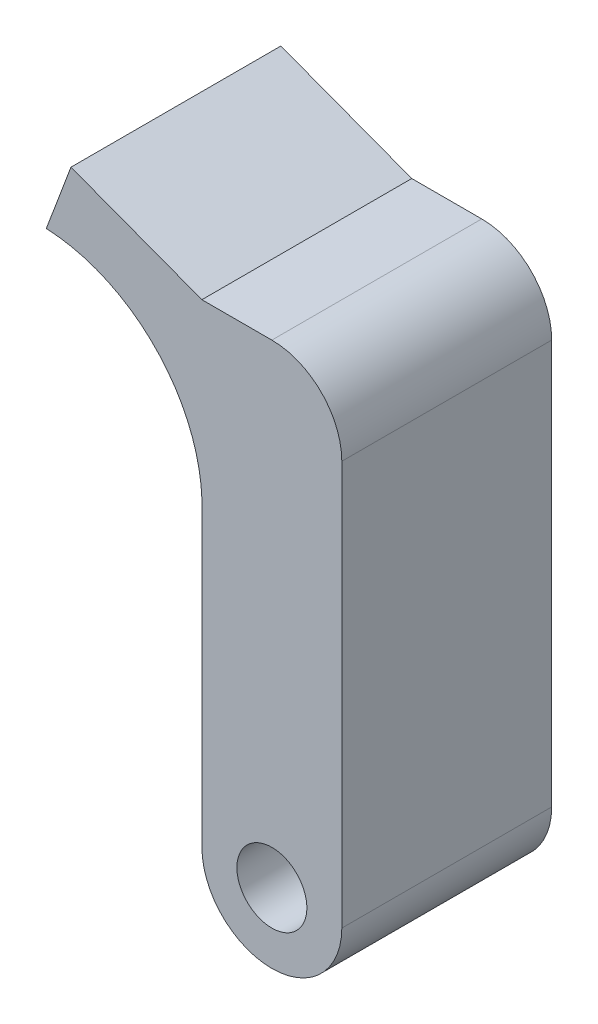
ISO-10303-21;
HEADER;
FILE_DESCRIPTION(('STEP AP214'),'2;1');
FILE_NAME('part.step','',(''),(''),'','','');
FILE_SCHEMA(('AUTOMOTIVE_DESIGN { 1 0 10303 214 1 1 1 1 }'));
ENDSEC;
DATA;
#1=APPLICATION_CONTEXT('core data for automotive mechanical design processes');
#2=APPLICATION_PROTOCOL_DEFINITION('international standard','automotive_design',2000,#1);
#3=PRODUCT_CONTEXT('',#1,'mechanical');
#4=PRODUCT('Part','Part','',(#3));
#5=PRODUCT_RELATED_PRODUCT_CATEGORY('part','',(#4));
#6=PRODUCT_DEFINITION_FORMATION('','',#4);
#7=PRODUCT_DEFINITION_CONTEXT('part definition',#1,'design');
#8=PRODUCT_DEFINITION('design','',#6,#7);
#9=PRODUCT_DEFINITION_SHAPE('','',#8);
#10=(LENGTH_UNIT() NAMED_UNIT(*) SI_UNIT(.MILLI.,.METRE.));
#11=(NAMED_UNIT(*) PLANE_ANGLE_UNIT() SI_UNIT($,.RADIAN.));
#12=(NAMED_UNIT(*) SI_UNIT($,.STERADIAN.) SOLID_ANGLE_UNIT());
#13=UNCERTAINTY_MEASURE_WITH_UNIT(LENGTH_MEASURE(1.E-05),#10,'distance_accuracy_value','');
#14=(GEOMETRIC_REPRESENTATION_CONTEXT(3) GLOBAL_UNCERTAINTY_ASSIGNED_CONTEXT((#13)) GLOBAL_UNIT_ASSIGNED_CONTEXT((#10,
#11,#12)) REPRESENTATION_CONTEXT('',''));
#15=CARTESIAN_POINT('',(0.,0.,0.));
#16=DIRECTION('',(0.,0.,1.));
#17=DIRECTION('',(1.,0.,0.));
#18=AXIS2_PLACEMENT_3D('',#15,#16,#17);
#19=CARTESIAN_POINT('',(-40.6247367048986,-11.9375557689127,19.05));
#20=DIRECTION('',(0.935852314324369,-0.352392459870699,0.));
#21=DIRECTION('',(0.352392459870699,0.935852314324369,0.));
#22=AXIS2_PLACEMENT_3D('',#19,#20,#21);
#23=PLANE('',#22);
#24=DIRECTION('',(-0.352392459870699,-0.935852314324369,0.));
#25=VECTOR('',#24,1.);
#26=CARTESIAN_POINT('',(-40.6247367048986,-11.9375557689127,0.));
#27=LINE('',#26,#25);
#28=CARTESIAN_POINT('',(-18.2353243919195,47.5222389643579,0.));
#29=VERTEX_POINT('',#28);
#30=CARTESIAN_POINT('',(-20.4730165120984,41.5795767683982,0.));
#31=VERTEX_POINT('',#30);
#32=EDGE_CURVE('E133',#29,#31,#27,.T.);
#33=ORIENTED_EDGE('',*,*,#32,.T.);
#34=DIRECTION('',(0.,0.,-1.));
#35=VECTOR('',#34,1.);
#36=CARTESIAN_POINT('',(-20.4730165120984,41.5795767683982,19.05));
#37=LINE('',#36,#35);
#38=CARTESIAN_POINT('',(-20.4730165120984,41.5795767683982,19.05));
#39=VERTEX_POINT('',#38);
#40=EDGE_CURVE('E11',#39,#31,#37,.T.);
#41=ORIENTED_EDGE('',*,*,#40,.F.);
#42=DIRECTION('',(-0.352392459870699,-0.935852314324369,0.));
#43=VECTOR('',#42,1.);
#44=CARTESIAN_POINT('',(-40.6247367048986,-11.9375557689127,19.05));
#45=LINE('',#44,#43);
#46=CARTESIAN_POINT('',(-18.2353243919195,47.5222389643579,19.05));
#47=VERTEX_POINT('',#46);
#48=EDGE_CURVE('E154',#47,#39,#45,.T.);
#49=ORIENTED_EDGE('',*,*,#48,.F.);
#50=DIRECTION('',(0.,0.,-1.));
#51=VECTOR('',#50,1.);
#52=CARTESIAN_POINT('',(-18.2353243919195,47.5222389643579,19.05));
#53=LINE('',#52,#51);
#54=EDGE_CURVE('E132',#47,#29,#53,.T.);
#55=ORIENTED_EDGE('',*,*,#54,.T.);
#56=EDGE_LOOP('',(#33,#41,#49,#55));
#57=FACE_BOUND('',#56,.T.);
#58=ADVANCED_FACE('F35',(#57),#23,.F.);
#59=CARTESIAN_POINT('',(-21.1477663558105,26.7818104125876,19.05));
#60=DIRECTION('',(0.,0.,-1.));
#61=DIRECTION('',(-1.,0.,0.));
#62=AXIS2_PLACEMENT_3D('',#59,#60,#61);
#63=CYLINDRICAL_SURFACE('',#62,14.8131420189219);
#64=CARTESIAN_POINT('',(-21.1477663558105,26.7818104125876,0.));
#65=DIRECTION('',(0.,0.,1.));
#66=DIRECTION('',(1.,0.,0.));
#67=AXIS2_PLACEMENT_3D('',#64,#65,#66);
#68=CIRCLE('',#67,14.8131420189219);
#69=CARTESIAN_POINT('',(-6.35,26.1070605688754,0.));
#70=VERTEX_POINT('',#69);
#71=EDGE_CURVE('E136',#31,#70,#68,.F.);
#72=ORIENTED_EDGE('',*,*,#71,.T.);
#73=DIRECTION('',(0.,0.,-1.));
#74=VECTOR('',#73,1.);
#75=CARTESIAN_POINT('',(-6.35,26.1070605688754,19.05));
#76=LINE('',#75,#74);
#77=CARTESIAN_POINT('',(-6.35,26.1070605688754,19.05));
#78=VERTEX_POINT('',#77);
#79=EDGE_CURVE('E43',#78,#70,#76,.T.);
#80=ORIENTED_EDGE('',*,*,#79,.F.);
#81=CARTESIAN_POINT('',(-21.1477663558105,26.7818104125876,19.05));
#82=DIRECTION('',(0.,0.,1.));
#83=DIRECTION('',(1.,0.,0.));
#84=AXIS2_PLACEMENT_3D('',#81,#82,#83);
#85=CIRCLE('',#84,14.8131420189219);
#86=EDGE_CURVE('E90',#39,#78,#85,.F.);
#87=ORIENTED_EDGE('',*,*,#86,.F.);
#88=ORIENTED_EDGE('',*,*,#40,.T.);
#89=EDGE_LOOP('',(#72,#80,#87,#88));
#90=FACE_BOUND('',#89,.T.);
#91=ADVANCED_FACE('F168',(#90),#63,.F.);
#92=CARTESIAN_POINT('',(-6.35,-27.178249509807,19.05));
#93=DIRECTION('',(-1.,0.,0.));
#94=DIRECTION('',(0.,0.,1.));
#95=AXIS2_PLACEMENT_3D('',#92,#93,#94);
#96=PLANE('',#95);
#97=DIRECTION('',(0.,1.,0.));
#98=VECTOR('',#97,1.);
#99=CARTESIAN_POINT('',(-6.35,-27.178249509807,0.));
#100=LINE('',#99,#98);
#101=CARTESIAN_POINT('',(-6.35,0.,0.));
#102=VERTEX_POINT('',#101);
#103=EDGE_CURVE('E139',#102,#70,#100,.T.);
#104=ORIENTED_EDGE('',*,*,#103,.F.);
#105=DIRECTION('',(0.,0.,-1.));
#106=VECTOR('',#105,1.);
#107=CARTESIAN_POINT('',(-6.35,0.,19.05));
#108=LINE('',#107,#106);
#109=CARTESIAN_POINT('',(-6.35,0.,19.05));
#110=VERTEX_POINT('',#109);
#111=EDGE_CURVE('E161',#110,#102,#108,.T.);
#112=ORIENTED_EDGE('',*,*,#111,.F.);
#113=DIRECTION('',(0.,1.,0.));
#114=VECTOR('',#113,1.);
#115=CARTESIAN_POINT('',(-6.35,-27.178249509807,19.05));
#116=LINE('',#115,#114);
#117=EDGE_CURVE('E167',#110,#78,#116,.T.);
#118=ORIENTED_EDGE('',*,*,#117,.T.);
#119=ORIENTED_EDGE('',*,*,#79,.T.);
#120=EDGE_LOOP('',(#104,#112,#118,#119));
#121=FACE_BOUND('',#120,.T.);
#122=ADVANCED_FACE('F165',(#121),#96,.T.);
#123=CARTESIAN_POINT('',(0.,0.,19.05));
#124=DIRECTION('',(0.,0.,-1.));
#125=DIRECTION('',(-1.,0.,0.));
#126=AXIS2_PLACEMENT_3D('',#123,#124,#125);
#127=CYLINDRICAL_SURFACE('',#126,6.35);
#128=CARTESIAN_POINT('',(0.,0.,0.));
#129=DIRECTION('',(0.,0.,1.));
#130=DIRECTION('',(1.,0.,0.));
#131=AXIS2_PLACEMENT_3D('',#128,#129,#130);
#132=CIRCLE('',#131,6.35);
#133=CARTESIAN_POINT('',(6.35,0.,0.));
#134=VERTEX_POINT('',#133);
#135=EDGE_CURVE('E142',#102,#134,#132,.T.);
#136=ORIENTED_EDGE('',*,*,#135,.T.);
#137=DIRECTION('',(0.,0.,-1.));
#138=VECTOR('',#137,1.);
#139=CARTESIAN_POINT('',(6.35,0.,19.05));
#140=LINE('',#139,#138);
#141=CARTESIAN_POINT('',(6.35,0.,19.05));
#142=VERTEX_POINT('',#141);
#143=EDGE_CURVE('E158',#142,#134,#140,.T.);
#144=ORIENTED_EDGE('',*,*,#143,.F.);
#145=CARTESIAN_POINT('',(0.,0.,19.05));
#146=DIRECTION('',(0.,0.,1.));
#147=DIRECTION('',(1.,0.,0.));
#148=AXIS2_PLACEMENT_3D('',#145,#146,#147);
#149=CIRCLE('',#148,6.35);
#150=EDGE_CURVE('E182',#110,#142,#149,.T.);
#151=ORIENTED_EDGE('',*,*,#150,.F.);
#152=ORIENTED_EDGE('',*,*,#111,.T.);
#153=EDGE_LOOP('',(#136,#144,#151,#152));
#154=FACE_BOUND('',#153,.T.);
#155=ADVANCED_FACE('F178',(#154),#127,.T.);
#156=CARTESIAN_POINT('',(6.35,-27.178249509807,19.05));
#157=DIRECTION('',(-1.,0.,0.));
#158=DIRECTION('',(0.,0.,1.));
#159=AXIS2_PLACEMENT_3D('',#156,#157,#158);
#160=PLANE('',#159);
#161=DIRECTION('',(0.,1.,0.));
#162=VECTOR('',#161,1.);
#163=CARTESIAN_POINT('',(6.35,-27.178249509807,0.));
#164=LINE('',#163,#162);
#165=CARTESIAN_POINT('',(6.35,36.696854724,0.));
#166=VERTEX_POINT('',#165);
#167=EDGE_CURVE('E144',#134,#166,#164,.T.);
#168=ORIENTED_EDGE('',*,*,#167,.T.);
#169=DIRECTION('',(0.,0.,-1.));
#170=VECTOR('',#169,1.);
#171=CARTESIAN_POINT('',(6.35,36.696854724,19.05));
#172=LINE('',#171,#170);
#173=CARTESIAN_POINT('',(6.35,36.696854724,19.05));
#174=VERTEX_POINT('',#173);
#175=EDGE_CURVE('E115',#174,#166,#172,.T.);
#176=ORIENTED_EDGE('',*,*,#175,.F.);
#177=DIRECTION('',(0.,1.,0.));
#178=VECTOR('',#177,1.);
#179=CARTESIAN_POINT('',(6.35,-27.178249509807,19.05));
#180=LINE('',#179,#178);
#181=EDGE_CURVE('E121',#142,#174,#180,.T.);
#182=ORIENTED_EDGE('',*,*,#181,.F.);
#183=ORIENTED_EDGE('',*,*,#143,.T.);
#184=EDGE_LOOP('',(#168,#176,#182,#183));
#185=FACE_BOUND('',#184,.T.);
#186=ADVANCED_FACE('F181',(#185),#160,.F.);
#187=CARTESIAN_POINT('',(0.,36.696854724,19.05));
#188=DIRECTION('',(0.,0.,-1.));
#189=DIRECTION('',(-1.,0.,0.));
#190=AXIS2_PLACEMENT_3D('',#187,#188,#189);
#191=CYLINDRICAL_SURFACE('',#190,6.35);
#192=CARTESIAN_POINT('',(0.,36.696854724,0.));
#193=DIRECTION('',(0.,0.,1.));
#194=DIRECTION('',(1.,0.,0.));
#195=AXIS2_PLACEMENT_3D('',#192,#193,#194);
#196=CIRCLE('',#195,6.35);
#197=CARTESIAN_POINT('',(0.,43.046854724,0.));
#198=VERTEX_POINT('',#197);
#199=EDGE_CURVE('E110',#198,#166,#196,.F.);
#200=ORIENTED_EDGE('',*,*,#199,.F.);
#201=DIRECTION('',(0.,0.,-1.));
#202=VECTOR('',#201,1.);
#203=CARTESIAN_POINT('',(0.,43.046854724,19.05));
#204=LINE('',#203,#202);
#205=CARTESIAN_POINT('',(0.,43.046854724,19.05));
#206=VERTEX_POINT('',#205);
#207=EDGE_CURVE('E105',#206,#198,#204,.T.);
#208=ORIENTED_EDGE('',*,*,#207,.F.);
#209=CARTESIAN_POINT('',(0.,36.696854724,19.05));
#210=DIRECTION('',(0.,0.,1.));
#211=DIRECTION('',(1.,0.,0.));
#212=AXIS2_PLACEMENT_3D('',#209,#210,#211);
#213=CIRCLE('',#212,6.35);
#214=EDGE_CURVE('E108',#206,#174,#213,.F.);
#215=ORIENTED_EDGE('',*,*,#214,.T.);
#216=ORIENTED_EDGE('',*,*,#175,.T.);
#217=EDGE_LOOP('',(#200,#208,#215,#216));
#218=FACE_BOUND('',#217,.T.);
#219=ADVANCED_FACE('F107',(#218),#191,.T.);
#220=CARTESIAN_POINT('',(-0.149868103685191,43.046854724,19.05));
#221=DIRECTION('',(0.,1.,0.));
#222=DIRECTION('',(0.,0.,1.));
#223=AXIS2_PLACEMENT_3D('',#220,#221,#222);
#224=PLANE('',#223);
#225=DIRECTION('',(1.,0.,0.));
#226=VECTOR('',#225,1.);
#227=CARTESIAN_POINT('',(-0.149868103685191,43.046854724,0.));
#228=LINE('',#227,#226);
#229=CARTESIAN_POINT('',(-6.35,43.046854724,0.));
#230=VERTEX_POINT('',#229);
#231=EDGE_CURVE('E148',#230,#198,#228,.T.);
#232=ORIENTED_EDGE('',*,*,#231,.F.);
#233=DIRECTION('',(0.,0.,-1.));
#234=VECTOR('',#233,1.);
#235=CARTESIAN_POINT('',(-6.35,43.046854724,19.05));
#236=LINE('',#235,#234);
#237=CARTESIAN_POINT('',(-6.35,43.046854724,19.05));
#238=VERTEX_POINT('',#237);
#239=EDGE_CURVE('E79',#238,#230,#236,.T.);
#240=ORIENTED_EDGE('',*,*,#239,.F.);
#241=DIRECTION('',(1.,0.,0.));
#242=VECTOR('',#241,1.);
#243=CARTESIAN_POINT('',(-0.149868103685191,43.046854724,19.05));
#244=LINE('',#243,#242);
#245=EDGE_CURVE('E119',#238,#206,#244,.T.);
#246=ORIENTED_EDGE('',*,*,#245,.T.);
#247=ORIENTED_EDGE('',*,*,#207,.T.);
#248=EDGE_LOOP('',(#232,#240,#246,#247));
#249=FACE_BOUND('',#248,.T.);
#250=ADVANCED_FACE('F124',(#249),#224,.T.);
#251=CARTESIAN_POINT('',(22.239544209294,32.2815452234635,19.05));
#252=DIRECTION('',(-0.3523924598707,-0.935852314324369,0.));
#253=DIRECTION('',(0.935852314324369,-0.3523924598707,0.));
#254=AXIS2_PLACEMENT_3D('',#251,#252,#253);
#255=PLANE('',#254);
#256=DIRECTION('',(-0.935852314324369,0.3523924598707,0.));
#257=VECTOR('',#256,1.);
#258=CARTESIAN_POINT('',(22.239544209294,32.2815452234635,0.));
#259=LINE('',#258,#257);
#260=EDGE_CURVE('E82',#230,#29,#259,.T.);
#261=ORIENTED_EDGE('',*,*,#260,.T.);
#262=ORIENTED_EDGE('',*,*,#54,.F.);
#263=DIRECTION('',(-0.935852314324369,0.3523924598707,0.));
#264=VECTOR('',#263,1.);
#265=CARTESIAN_POINT('',(22.239544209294,32.2815452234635,19.05));
#266=LINE('',#265,#264);
#267=EDGE_CURVE('E51',#238,#47,#266,.T.);
#268=ORIENTED_EDGE('',*,*,#267,.F.);
#269=ORIENTED_EDGE('',*,*,#239,.T.);
#270=EDGE_LOOP('',(#261,#262,#268,#269));
#271=FACE_BOUND('',#270,.T.);
#272=ADVANCED_FACE('F189',(#271),#255,.F.);
#273=CARTESIAN_POINT('',(0.,0.,19.05));
#274=DIRECTION('',(0.,0.,-1.));
#275=DIRECTION('',(-1.,0.,0.));
#276=AXIS2_PLACEMENT_3D('',#273,#274,#275);
#277=CYLINDRICAL_SURFACE('',#276,3.175);
#278=CARTESIAN_POINT('',(0.,0.,19.05));
#279=DIRECTION('',(0.,0.,1.));
#280=DIRECTION('',(1.,0.,0.));
#281=AXIS2_PLACEMENT_3D('',#278,#279,#280);
#282=CIRCLE('',#281,3.175);
#283=CARTESIAN_POINT('',(-3.175,0.,19.05));
#284=VERTEX_POINT('',#283);
#285=EDGE_CURVE('E126',#284,#284,#282,.T.);
#286=CARTESIAN_POINT('',(0.,0.,0.));
#287=DIRECTION('',(0.,0.,1.));
#288=DIRECTION('',(1.,0.,0.));
#289=AXIS2_PLACEMENT_3D('',#286,#287,#288);
#290=CIRCLE('',#289,3.175);
#291=CARTESIAN_POINT('',(-3.175,0.,0.));
#292=VERTEX_POINT('',#291);
#293=EDGE_CURVE('E151',#292,#292,#290,.T.);
#294=CARTESIAN_POINT('',(-3.175,0.,19.05));
#295=CARTESIAN_POINT('',(-3.175,0.,18.8515625));
#296=CARTESIAN_POINT('',(-3.175,0.,18.653125));
#297=CARTESIAN_POINT('',(-3.175,0.,18.25625));
#298=CARTESIAN_POINT('',(-3.175,0.,18.0578125));
#299=CARTESIAN_POINT('',(-3.175,0.,17.6609375));
#300=CARTESIAN_POINT('',(-3.175,0.,17.4625));
#301=CARTESIAN_POINT('',(-3.175,0.,17.065625));
#302=CARTESIAN_POINT('',(-3.175,0.,16.8671875));
#303=CARTESIAN_POINT('',(-3.175,0.,16.4703125));
#304=CARTESIAN_POINT('',(-3.175,0.,16.271875));
#305=CARTESIAN_POINT('',(-3.175,0.,15.875));
#306=CARTESIAN_POINT('',(-3.175,0.,15.6765625));
#307=CARTESIAN_POINT('',(-3.175,0.,15.2796875));
#308=CARTESIAN_POINT('',(-3.175,0.,15.08125));
#309=CARTESIAN_POINT('',(-3.175,0.,14.684375));
#310=CARTESIAN_POINT('',(-3.175,0.,14.4859375));
#311=CARTESIAN_POINT('',(-3.175,0.,14.0890625));
#312=CARTESIAN_POINT('',(-3.175,0.,13.890625));
#313=CARTESIAN_POINT('',(-3.175,0.,13.49375));
#314=CARTESIAN_POINT('',(-3.175,0.,13.2953125));
#315=CARTESIAN_POINT('',(-3.175,0.,12.8984375));
#316=CARTESIAN_POINT('',(-3.175,0.,12.7));
#317=CARTESIAN_POINT('',(-3.175,0.,12.303125));
#318=CARTESIAN_POINT('',(-3.175,0.,12.1046875));
#319=CARTESIAN_POINT('',(-3.175,0.,11.7078125));
#320=CARTESIAN_POINT('',(-3.175,0.,11.509375));
#321=CARTESIAN_POINT('',(-3.175,0.,11.1125));
#322=CARTESIAN_POINT('',(-3.175,0.,10.9140625));
#323=CARTESIAN_POINT('',(-3.175,0.,10.5171875));
#324=CARTESIAN_POINT('',(-3.175,0.,10.31875));
#325=CARTESIAN_POINT('',(-3.175,0.,9.921875));
#326=CARTESIAN_POINT('',(-3.175,0.,9.7234375));
#327=CARTESIAN_POINT('',(-3.175,0.,9.3265625));
#328=CARTESIAN_POINT('',(-3.175,0.,9.128125));
#329=CARTESIAN_POINT('',(-3.175,0.,8.73125));
#330=CARTESIAN_POINT('',(-3.175,0.,8.5328125));
#331=CARTESIAN_POINT('',(-3.175,0.,8.1359375));
#332=CARTESIAN_POINT('',(-3.175,0.,7.9375));
#333=CARTESIAN_POINT('',(-3.175,0.,7.540625));
#334=CARTESIAN_POINT('',(-3.175,0.,7.3421875));
#335=CARTESIAN_POINT('',(-3.175,0.,6.9453125));
#336=CARTESIAN_POINT('',(-3.175,0.,6.746875));
#337=CARTESIAN_POINT('',(-3.175,0.,6.35));
#338=CARTESIAN_POINT('',(-3.175,0.,6.1515625));
#339=CARTESIAN_POINT('',(-3.175,0.,5.7546875));
#340=CARTESIAN_POINT('',(-3.175,0.,5.55625));
#341=CARTESIAN_POINT('',(-3.175,0.,5.159375));
#342=CARTESIAN_POINT('',(-3.175,0.,4.9609375));
#343=CARTESIAN_POINT('',(-3.175,0.,4.5640625));
#344=CARTESIAN_POINT('',(-3.175,0.,4.365625));
#345=CARTESIAN_POINT('',(-3.175,0.,3.96875));
#346=CARTESIAN_POINT('',(-3.175,0.,3.7703125));
#347=CARTESIAN_POINT('',(-3.175,0.,3.3734375));
#348=CARTESIAN_POINT('',(-3.175,0.,3.175));
#349=CARTESIAN_POINT('',(-3.175,0.,2.778125));
#350=CARTESIAN_POINT('',(-3.175,0.,2.5796875));
#351=CARTESIAN_POINT('',(-3.175,0.,2.1828125));
#352=CARTESIAN_POINT('',(-3.175,0.,1.984375));
#353=CARTESIAN_POINT('',(-3.175,0.,1.5875));
#354=CARTESIAN_POINT('',(-3.175,0.,1.3890625));
#355=CARTESIAN_POINT('',(-3.175,0.,0.992187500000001));
#356=CARTESIAN_POINT('',(-3.175,0.,0.793750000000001));
#357=CARTESIAN_POINT('',(-3.175,0.,0.396875));
#358=CARTESIAN_POINT('',(-3.175,0.,0.1984375));
#359=CARTESIAN_POINT('',(-3.175,0.,0.));
#360=B_SPLINE_CURVE_WITH_KNOTS('',3,(#294,#295,#296,#297,#298,#299,#300,#301,#302,#303,#304,
#305,#306,#307,#308,#309,#310,#311,#312,#313,#314,#315,#316,#317,#318,#319,#320,#321,#322,#323,
#324,#325,#326,#327,#328,#329,#330,#331,#332,#333,#334,#335,#336,#337,#338,#339,#340,#341,#342,
#343,#344,#345,#346,#347,#348,#349,#350,#351,#352,#353,#354,#355,#356,#357,#358,#359),
.UNSPECIFIED.,.F.,.F.,(4,2,2,2,2,2,2,2,2,2,2,2,2,2,2,2,2,2,2,2,2,2,2,2,2,2,2,2,2,2,2,2,4),(0.,
0.595312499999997,1.190625,1.7859375,2.38125,2.9765625,3.571875,4.1671875,4.7625,5.3578125,
5.953125,6.5484375,7.14375,7.7390625,8.334375,8.9296875,9.525,10.1203125,10.715625,11.3109375,
11.90625,12.5015625,13.096875,13.6921875,14.2875,14.8828125,15.478125,16.0734375,16.66875,
17.2640625,17.859375,18.4546875,19.05),.UNSPECIFIED.);
#361=EDGE_CURVE('BSEAM191',#284,#292,#360,.T.);
#362=ORIENTED_EDGE('',*,*,#285,.T.);
#363=ORIENTED_EDGE('',*,*,#293,.F.);
#364=ORIENTED_EDGE('',*,*,#361,.T.);
#365=ORIENTED_EDGE('',*,*,#361,.F.);
#366=EDGE_LOOP('',(#362,#364,#363,#365));
#367=FACE_BOUND('',#366,.T.);
#368=ADVANCED_FACE('F191',(#367),#277,.F.);
#369=CARTESIAN_POINT('',(-0.149868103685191,-27.178249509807,19.05));
#370=DIRECTION('',(0.,0.,1.));
#371=DIRECTION('',(1.,0.,0.));
#372=AXIS2_PLACEMENT_3D('',#369,#370,#371);
#373=PLANE('',#372);
#374=ORIENTED_EDGE('',*,*,#48,.T.);
#375=ORIENTED_EDGE('',*,*,#86,.T.);
#376=ORIENTED_EDGE('',*,*,#117,.F.);
#377=ORIENTED_EDGE('',*,*,#150,.T.);
#378=ORIENTED_EDGE('',*,*,#181,.T.);
#379=ORIENTED_EDGE('',*,*,#214,.F.);
#380=ORIENTED_EDGE('',*,*,#245,.F.);
#381=ORIENTED_EDGE('',*,*,#267,.T.);
#382=EDGE_LOOP('',(#374,#375,#376,#377,#378,#379,#380,#381));
#383=FACE_BOUND('',#382,.T.);
#384=ORIENTED_EDGE('',*,*,#285,.F.);
#385=EDGE_LOOP('',(#384));
#386=FACE_BOUND('',#385,.T.);
#387=ADVANCED_FACE('F117',(#383,#386),#373,.T.);
#388=CARTESIAN_POINT('',(-0.149868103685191,-27.178249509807,0.));
#389=DIRECTION('',(0.,0.,1.));
#390=DIRECTION('',(1.,0.,0.));
#391=AXIS2_PLACEMENT_3D('',#388,#389,#390);
#392=PLANE('',#391);
#393=ORIENTED_EDGE('',*,*,#32,.F.);
#394=ORIENTED_EDGE('',*,*,#260,.F.);
#395=ORIENTED_EDGE('',*,*,#231,.T.);
#396=ORIENTED_EDGE('',*,*,#199,.T.);
#397=ORIENTED_EDGE('',*,*,#167,.F.);
#398=ORIENTED_EDGE('',*,*,#135,.F.);
#399=ORIENTED_EDGE('',*,*,#103,.T.);
#400=ORIENTED_EDGE('',*,*,#71,.F.);
#401=EDGE_LOOP('',(#393,#394,#395,#396,#397,#398,#399,#400));
#402=FACE_BOUND('',#401,.T.);
#403=ORIENTED_EDGE('',*,*,#293,.T.);
#404=EDGE_LOOP('',(#403));
#405=FACE_BOUND('',#404,.T.);
#406=ADVANCED_FACE('F173',(#402,#405),#392,.F.);
#407=CLOSED_SHELL('',(#58,#91,#122,#155,#186,#219,#250,#272,#368,#387,#406));
#408=MANIFOLD_SOLID_BREP('B2',#407);
#409=ADVANCED_BREP_SHAPE_REPRESENTATION('',(#18,#408),#14);
#410=SHAPE_DEFINITION_REPRESENTATION(#9,#409);
ENDSEC;
END-ISO-10303-21;
